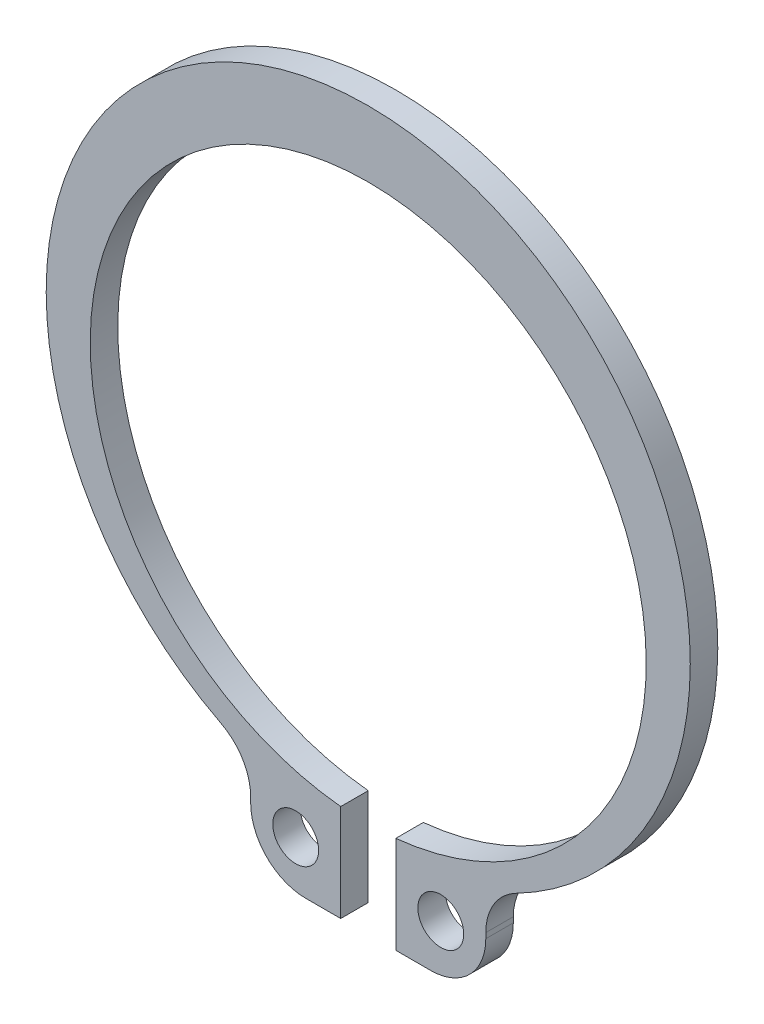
ISO-10303-21;
HEADER;
FILE_DESCRIPTION(('STEP AP214'),'2;1');
FILE_NAME('part.step','',(''),(''),'','','');
FILE_SCHEMA(('AUTOMOTIVE_DESIGN { 1 0 10303 214 1 1 1 1 }'));
ENDSEC;
DATA;
#1=APPLICATION_CONTEXT('core data for automotive mechanical design processes');
#2=APPLICATION_PROTOCOL_DEFINITION('international standard','automotive_design',2000,#1);
#3=PRODUCT_CONTEXT('',#1,'mechanical');
#4=PRODUCT('Part','Part','',(#3));
#5=PRODUCT_RELATED_PRODUCT_CATEGORY('part','',(#4));
#6=PRODUCT_DEFINITION_FORMATION('','',#4);
#7=PRODUCT_DEFINITION_CONTEXT('part definition',#1,'design');
#8=PRODUCT_DEFINITION('design','',#6,#7);
#9=PRODUCT_DEFINITION_SHAPE('','',#8);
#10=(LENGTH_UNIT() NAMED_UNIT(*) SI_UNIT(.MILLI.,.METRE.));
#11=(NAMED_UNIT(*) PLANE_ANGLE_UNIT() SI_UNIT($,.RADIAN.));
#12=(NAMED_UNIT(*) SI_UNIT($,.STERADIAN.) SOLID_ANGLE_UNIT());
#13=UNCERTAINTY_MEASURE_WITH_UNIT(LENGTH_MEASURE(1.E-05),#10,'distance_accuracy_value','');
#14=(GEOMETRIC_REPRESENTATION_CONTEXT(3) GLOBAL_UNCERTAINTY_ASSIGNED_CONTEXT((#13)) GLOBAL_UNIT_ASSIGNED_CONTEXT((#10,
#11,#12)) REPRESENTATION_CONTEXT('',''));
#15=CARTESIAN_POINT('',(0.,0.,0.));
#16=DIRECTION('',(0.,0.,1.));
#17=DIRECTION('',(1.,0.,0.));
#18=AXIS2_PLACEMENT_3D('',#15,#16,#17);
#19=CARTESIAN_POINT('',(-9.40667556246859,-17.0706583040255,1.5));
#20=DIRECTION('',(0.,0.,-1.));
#21=DIRECTION('',(-1.,0.,0.));
#22=AXIS2_PLACEMENT_3D('',#19,#20,#21);
#23=CYLINDRICAL_SURFACE('',#22,3.);
#24=CARTESIAN_POINT('',(-9.40667556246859,-17.0706583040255,0.));
#25=DIRECTION('',(0.,0.,1.));
#26=DIRECTION('',(1.,0.,0.));
#27=AXIS2_PLACEMENT_3D('',#24,#25,#26);
#28=CIRCLE('',#27,3.);
#29=CARTESIAN_POINT('',(-6.40667556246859,-17.0706583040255,0.));
#30=VERTEX_POINT('',#29);
#31=CARTESIAN_POINT('',(-8.03343825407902,-14.4034089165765,0.));
#32=VERTEX_POINT('',#31);
#33=EDGE_CURVE('E125',#30,#32,#28,.T.);
#34=ORIENTED_EDGE('',*,*,#33,.F.);
#35=DIRECTION('',(0.,0.,-1.));
#36=VECTOR('',#35,1.);
#37=CARTESIAN_POINT('',(-6.40667556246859,-17.0706583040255,1.5));
#38=LINE('',#37,#36);
#39=CARTESIAN_POINT('',(-6.40667556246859,-17.0706583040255,1.5));
#40=VERTEX_POINT('',#39);
#41=EDGE_CURVE('E30',#40,#30,#38,.T.);
#42=ORIENTED_EDGE('',*,*,#41,.F.);
#43=CARTESIAN_POINT('',(-9.40667556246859,-17.0706583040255,1.5));
#44=DIRECTION('',(0.,0.,1.));
#45=DIRECTION('',(1.,0.,0.));
#46=AXIS2_PLACEMENT_3D('',#43,#44,#45);
#47=CIRCLE('',#46,3.);
#48=CARTESIAN_POINT('',(-8.03343825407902,-14.4034089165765,1.5));
#49=VERTEX_POINT('',#48);
#50=EDGE_CURVE('E155',#40,#49,#47,.T.);
#51=ORIENTED_EDGE('',*,*,#50,.T.);
#52=DIRECTION('',(0.,0.,-1.));
#53=VECTOR('',#52,1.);
#54=CARTESIAN_POINT('',(-8.03343825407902,-14.4034089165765,1.5));
#55=LINE('',#54,#53);
#56=EDGE_CURVE('E11',#49,#32,#55,.T.);
#57=ORIENTED_EDGE('',*,*,#56,.T.);
#58=EDGE_LOOP('',(#34,#42,#51,#57));
#59=FACE_BOUND('',#58,.T.);
#60=ADVANCED_FACE('F16',(#59),#23,.F.);
#61=CARTESIAN_POINT('',(0.,1.2,1.5));
#62=DIRECTION('',(0.,0.,-1.));
#63=DIRECTION('',(-1.,0.,0.));
#64=AXIS2_PLACEMENT_3D('',#61,#62,#63);
#65=CYLINDRICAL_SURFACE('',#64,17.55);
#66=CARTESIAN_POINT('',(0.,1.2,0.));
#67=DIRECTION('',(0.,0.,1.));
#68=DIRECTION('',(1.,0.,0.));
#69=AXIS2_PLACEMENT_3D('',#66,#67,#68);
#70=CIRCLE('',#69,17.55);
#71=CARTESIAN_POINT('',(8.033438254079,-14.4034089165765,0.));
#72=VERTEX_POINT('',#71);
#73=EDGE_CURVE('E107',#72,#32,#70,.T.);
#74=ORIENTED_EDGE('',*,*,#73,.T.);
#75=ORIENTED_EDGE('',*,*,#56,.F.);
#76=CARTESIAN_POINT('',(0.,1.2,1.5));
#77=DIRECTION('',(0.,0.,1.));
#78=DIRECTION('',(1.,0.,0.));
#79=AXIS2_PLACEMENT_3D('',#76,#77,#78);
#80=CIRCLE('',#79,17.55);
#81=CARTESIAN_POINT('',(8.033438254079,-14.4034089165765,1.5));
#82=VERTEX_POINT('',#81);
#83=EDGE_CURVE('E110',#82,#49,#80,.T.);
#84=ORIENTED_EDGE('',*,*,#83,.F.);
#85=DIRECTION('',(0.,0.,-1.));
#86=VECTOR('',#85,1.);
#87=CARTESIAN_POINT('',(8.033438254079,-14.4034089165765,1.5));
#88=LINE('',#87,#86);
#89=EDGE_CURVE('E19',#82,#72,#88,.T.);
#90=ORIENTED_EDGE('',*,*,#89,.T.);
#91=EDGE_LOOP('',(#74,#75,#84,#90));
#92=FACE_BOUND('',#91,.T.);
#93=ADVANCED_FACE('F105',(#92),#65,.T.);
#94=CARTESIAN_POINT('',(9.40667556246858,-17.0706583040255,1.5));
#95=DIRECTION('',(0.,0.,-1.));
#96=DIRECTION('',(-1.,0.,0.));
#97=AXIS2_PLACEMENT_3D('',#94,#95,#96);
#98=CYLINDRICAL_SURFACE('',#97,3.);
#99=CARTESIAN_POINT('',(9.40667556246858,-17.0706583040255,0.));
#100=DIRECTION('',(0.,0.,1.));
#101=DIRECTION('',(1.,0.,0.));
#102=AXIS2_PLACEMENT_3D('',#99,#100,#101);
#103=CIRCLE('',#102,3.);
#104=CARTESIAN_POINT('',(6.40667556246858,-17.0706583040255,0.));
#105=VERTEX_POINT('',#104);
#106=EDGE_CURVE('E116',#72,#105,#103,.T.);
#107=ORIENTED_EDGE('',*,*,#106,.F.);
#108=ORIENTED_EDGE('',*,*,#89,.F.);
#109=CARTESIAN_POINT('',(9.40667556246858,-17.0706583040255,1.5));
#110=DIRECTION('',(0.,0.,1.));
#111=DIRECTION('',(1.,0.,0.));
#112=AXIS2_PLACEMENT_3D('',#109,#110,#111);
#113=CIRCLE('',#112,3.);
#114=CARTESIAN_POINT('',(6.40667556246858,-17.0706583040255,1.5));
#115=VERTEX_POINT('',#114);
#116=EDGE_CURVE('E158',#82,#115,#113,.T.);
#117=ORIENTED_EDGE('',*,*,#116,.T.);
#118=DIRECTION('',(0.,0.,-1.));
#119=VECTOR('',#118,1.);
#120=CARTESIAN_POINT('',(6.40667556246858,-17.0706583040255,1.5));
#121=LINE('',#120,#119);
#122=EDGE_CURVE('E114',#115,#105,#121,.T.);
#123=ORIENTED_EDGE('',*,*,#122,.T.);
#124=EDGE_LOOP('',(#107,#108,#117,#123));
#125=FACE_BOUND('',#124,.T.);
#126=ADVANCED_FACE('F117',(#125),#98,.F.);
#127=CARTESIAN_POINT('',(6.40667556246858,-17.36,1.5));
#128=DIRECTION('',(-1.,0.,0.));
#129=DIRECTION('',(0.,-1.,0.));
#130=AXIS2_PLACEMENT_3D('',#127,#128,#129);
#131=PLANE('',#130);
#132=DIRECTION('',(0.,1.,0.));
#133=VECTOR('',#132,1.);
#134=CARTESIAN_POINT('',(6.40667556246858,-17.36,0.));
#135=LINE('',#134,#133);
#136=CARTESIAN_POINT('',(6.40667556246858,-17.36,0.));
#137=VERTEX_POINT('',#136);
#138=EDGE_CURVE('E121',#137,#105,#135,.T.);
#139=ORIENTED_EDGE('',*,*,#138,.T.);
#140=ORIENTED_EDGE('',*,*,#122,.F.);
#141=DIRECTION('',(0.,1.,0.));
#142=VECTOR('',#141,1.);
#143=CARTESIAN_POINT('',(6.40667556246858,-17.36,1.5));
#144=LINE('',#143,#142);
#145=CARTESIAN_POINT('',(6.40667556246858,-17.36,1.5));
#146=VERTEX_POINT('',#145);
#147=EDGE_CURVE('E160',#146,#115,#144,.T.);
#148=ORIENTED_EDGE('',*,*,#147,.F.);
#149=DIRECTION('',(0.,0.,-1.));
#150=VECTOR('',#149,1.);
#151=CARTESIAN_POINT('',(6.40667556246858,-17.36,1.5));
#152=LINE('',#151,#150);
#153=EDGE_CURVE('E202',#146,#137,#152,.T.);
#154=ORIENTED_EDGE('',*,*,#153,.T.);
#155=EDGE_LOOP('',(#139,#140,#148,#154));
#156=FACE_BOUND('',#155,.T.);
#157=ADVANCED_FACE('F206',(#156),#131,.F.);
#158=CARTESIAN_POINT('',(3.40667556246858,-17.36,1.5));
#159=DIRECTION('',(0.,0.,-1.));
#160=DIRECTION('',(-1.,0.,0.));
#161=AXIS2_PLACEMENT_3D('',#158,#159,#160);
#162=CYLINDRICAL_SURFACE('',#161,3.);
#163=CARTESIAN_POINT('',(3.40667556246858,-17.36,0.));
#164=DIRECTION('',(0.,0.,1.));
#165=DIRECTION('',(1.,0.,0.));
#166=AXIS2_PLACEMENT_3D('',#163,#164,#165);
#167=CIRCLE('',#166,3.);
#168=CARTESIAN_POINT('',(3.40667556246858,-20.36,0.));
#169=VERTEX_POINT('',#168);
#170=EDGE_CURVE('E133',#169,#137,#167,.T.);
#171=ORIENTED_EDGE('',*,*,#170,.T.);
#172=ORIENTED_EDGE('',*,*,#153,.F.);
#173=CARTESIAN_POINT('',(3.40667556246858,-17.36,1.5));
#174=DIRECTION('',(0.,0.,1.));
#175=DIRECTION('',(1.,0.,0.));
#176=AXIS2_PLACEMENT_3D('',#173,#174,#175);
#177=CIRCLE('',#176,3.);
#178=CARTESIAN_POINT('',(3.40667556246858,-20.36,1.5));
#179=VERTEX_POINT('',#178);
#180=EDGE_CURVE('E163',#179,#146,#177,.T.);
#181=ORIENTED_EDGE('',*,*,#180,.F.);
#182=DIRECTION('',(0.,0.,-1.));
#183=VECTOR('',#182,1.);
#184=CARTESIAN_POINT('',(3.40667556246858,-20.36,1.5));
#185=LINE('',#184,#183);
#186=EDGE_CURVE('E200',#179,#169,#185,.T.);
#187=ORIENTED_EDGE('',*,*,#186,.T.);
#188=EDGE_LOOP('',(#171,#172,#181,#187));
#189=FACE_BOUND('',#188,.T.);
#190=ADVANCED_FACE('F210',(#189),#162,.T.);
#191=CARTESIAN_POINT('',(1.5,-20.36,1.5));
#192=DIRECTION('',(0.,1.,0.));
#193=DIRECTION('',(0.,0.,1.));
#194=AXIS2_PLACEMENT_3D('',#191,#192,#193);
#195=PLANE('',#194);
#196=DIRECTION('',(1.,0.,0.));
#197=VECTOR('',#196,1.);
#198=CARTESIAN_POINT('',(1.5,-20.36,0.));
#199=LINE('',#198,#197);
#200=CARTESIAN_POINT('',(1.5,-20.36,0.));
#201=VERTEX_POINT('',#200);
#202=EDGE_CURVE('E136',#201,#169,#199,.T.);
#203=ORIENTED_EDGE('',*,*,#202,.T.);
#204=ORIENTED_EDGE('',*,*,#186,.F.);
#205=DIRECTION('',(1.,0.,0.));
#206=VECTOR('',#205,1.);
#207=CARTESIAN_POINT('',(1.5,-20.36,1.5));
#208=LINE('',#207,#206);
#209=CARTESIAN_POINT('',(1.5,-20.36,1.5));
#210=VERTEX_POINT('',#209);
#211=EDGE_CURVE('E166',#210,#179,#208,.T.);
#212=ORIENTED_EDGE('',*,*,#211,.F.);
#213=DIRECTION('',(0.,0.,-1.));
#214=VECTOR('',#213,1.);
#215=CARTESIAN_POINT('',(1.5,-20.36,1.5));
#216=LINE('',#215,#214);
#217=EDGE_CURVE('E198',#210,#201,#216,.T.);
#218=ORIENTED_EDGE('',*,*,#217,.T.);
#219=EDGE_LOOP('',(#203,#204,#212,#218));
#220=FACE_BOUND('',#219,.T.);
#221=ADVANCED_FACE('F214',(#220),#195,.F.);
#222=CARTESIAN_POINT('',(1.5,-20.36,1.5));
#223=DIRECTION('',(-1.,0.,0.));
#224=DIRECTION('',(0.,-1.,0.));
#225=AXIS2_PLACEMENT_3D('',#222,#223,#224);
#226=PLANE('',#225);
#227=DIRECTION('',(0.,1.,0.));
#228=VECTOR('',#227,1.);
#229=CARTESIAN_POINT('',(1.5,-20.36,0.));
#230=LINE('',#229,#228);
#231=CARTESIAN_POINT('',(1.5,-15.0755596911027,0.));
#232=VERTEX_POINT('',#231);
#233=EDGE_CURVE('E139',#201,#232,#230,.T.);
#234=ORIENTED_EDGE('',*,*,#233,.F.);
#235=ORIENTED_EDGE('',*,*,#217,.F.);
#236=DIRECTION('',(0.,1.,0.));
#237=VECTOR('',#236,1.);
#238=CARTESIAN_POINT('',(1.5,-20.36,1.5));
#239=LINE('',#238,#237);
#240=CARTESIAN_POINT('',(1.5,-15.0755596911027,1.5));
#241=VERTEX_POINT('',#240);
#242=EDGE_CURVE('E169',#210,#241,#239,.T.);
#243=ORIENTED_EDGE('',*,*,#242,.T.);
#244=DIRECTION('',(0.,0.,-1.));
#245=VECTOR('',#244,1.);
#246=CARTESIAN_POINT('',(1.5,-15.0755596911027,1.5));
#247=LINE('',#246,#245);
#248=EDGE_CURVE('E196',#241,#232,#247,.T.);
#249=ORIENTED_EDGE('',*,*,#248,.T.);
#250=EDGE_LOOP('',(#234,#235,#243,#249));
#251=FACE_BOUND('',#250,.T.);
#252=ADVANCED_FACE('F218',(#251),#226,.T.);
#253=CARTESIAN_POINT('',(0.,0.,1.5));
#254=DIRECTION('',(0.,0.,-1.));
#255=DIRECTION('',(-1.,0.,0.));
#256=AXIS2_PLACEMENT_3D('',#253,#254,#255);
#257=CYLINDRICAL_SURFACE('',#256,15.15);
#258=CARTESIAN_POINT('',(0.,0.,0.));
#259=DIRECTION('',(0.,0.,1.));
#260=DIRECTION('',(1.,0.,0.));
#261=AXIS2_PLACEMENT_3D('',#258,#259,#260);
#262=CIRCLE('',#261,15.15);
#263=CARTESIAN_POINT('',(-1.5,-15.0755596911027,0.));
#264=VERTEX_POINT('',#263);
#265=EDGE_CURVE('E142',#232,#264,#262,.T.);
#266=ORIENTED_EDGE('',*,*,#265,.F.);
#267=ORIENTED_EDGE('',*,*,#248,.F.);
#268=CARTESIAN_POINT('',(0.,0.,1.5));
#269=DIRECTION('',(0.,0.,1.));
#270=DIRECTION('',(1.,0.,0.));
#271=AXIS2_PLACEMENT_3D('',#268,#269,#270);
#272=CIRCLE('',#271,15.15);
#273=CARTESIAN_POINT('',(-1.5,-15.0755596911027,1.5));
#274=VERTEX_POINT('',#273);
#275=EDGE_CURVE('E172',#241,#274,#272,.T.);
#276=ORIENTED_EDGE('',*,*,#275,.T.);
#277=DIRECTION('',(0.,0.,-1.));
#278=VECTOR('',#277,1.);
#279=CARTESIAN_POINT('',(-1.5,-15.0755596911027,1.5));
#280=LINE('',#279,#278);
#281=EDGE_CURVE('E194',#274,#264,#280,.T.);
#282=ORIENTED_EDGE('',*,*,#281,.T.);
#283=EDGE_LOOP('',(#266,#267,#276,#282));
#284=FACE_BOUND('',#283,.T.);
#285=ADVANCED_FACE('F222',(#284),#257,.F.);
#286=CARTESIAN_POINT('',(-1.5,-20.36,1.5));
#287=DIRECTION('',(-1.,0.,0.));
#288=DIRECTION('',(0.,-1.,0.));
#289=AXIS2_PLACEMENT_3D('',#286,#287,#288);
#290=PLANE('',#289);
#291=DIRECTION('',(0.,1.,0.));
#292=VECTOR('',#291,1.);
#293=CARTESIAN_POINT('',(-1.5,-20.36,0.));
#294=LINE('',#293,#292);
#295=CARTESIAN_POINT('',(-1.5,-20.36,0.));
#296=VERTEX_POINT('',#295);
#297=EDGE_CURVE('E145',#296,#264,#294,.T.);
#298=ORIENTED_EDGE('',*,*,#297,.T.);
#299=ORIENTED_EDGE('',*,*,#281,.F.);
#300=DIRECTION('',(0.,1.,0.));
#301=VECTOR('',#300,1.);
#302=CARTESIAN_POINT('',(-1.5,-20.36,1.5));
#303=LINE('',#302,#301);
#304=CARTESIAN_POINT('',(-1.5,-20.36,1.5));
#305=VERTEX_POINT('',#304);
#306=EDGE_CURVE('E175',#305,#274,#303,.T.);
#307=ORIENTED_EDGE('',*,*,#306,.F.);
#308=DIRECTION('',(0.,0.,-1.));
#309=VECTOR('',#308,1.);
#310=CARTESIAN_POINT('',(-1.5,-20.36,1.5));
#311=LINE('',#310,#309);
#312=EDGE_CURVE('E192',#305,#296,#311,.T.);
#313=ORIENTED_EDGE('',*,*,#312,.T.);
#314=EDGE_LOOP('',(#298,#299,#307,#313));
#315=FACE_BOUND('',#314,.T.);
#316=ADVANCED_FACE('F227',(#315),#290,.F.);
#317=CARTESIAN_POINT('',(-3.40667556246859,-20.36,1.5));
#318=DIRECTION('',(0.,1.,0.));
#319=DIRECTION('',(0.,0.,1.));
#320=AXIS2_PLACEMENT_3D('',#317,#318,#319);
#321=PLANE('',#320);
#322=DIRECTION('',(1.,0.,0.));
#323=VECTOR('',#322,1.);
#324=CARTESIAN_POINT('',(-3.40667556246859,-20.36,0.));
#325=LINE('',#324,#323);
#326=CARTESIAN_POINT('',(-3.40667556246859,-20.36,0.));
#327=VERTEX_POINT('',#326);
#328=EDGE_CURVE('E148',#327,#296,#325,.T.);
#329=ORIENTED_EDGE('',*,*,#328,.T.);
#330=ORIENTED_EDGE('',*,*,#312,.F.);
#331=DIRECTION('',(1.,0.,0.));
#332=VECTOR('',#331,1.);
#333=CARTESIAN_POINT('',(-3.40667556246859,-20.36,1.5));
#334=LINE('',#333,#332);
#335=CARTESIAN_POINT('',(-3.40667556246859,-20.36,1.5));
#336=VERTEX_POINT('',#335);
#337=EDGE_CURVE('E178',#336,#305,#334,.T.);
#338=ORIENTED_EDGE('',*,*,#337,.F.);
#339=DIRECTION('',(0.,0.,-1.));
#340=VECTOR('',#339,1.);
#341=CARTESIAN_POINT('',(-3.40667556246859,-20.36,1.5));
#342=LINE('',#341,#340);
#343=EDGE_CURVE('E190',#336,#327,#342,.T.);
#344=ORIENTED_EDGE('',*,*,#343,.T.);
#345=EDGE_LOOP('',(#329,#330,#338,#344));
#346=FACE_BOUND('',#345,.T.);
#347=ADVANCED_FACE('F231',(#346),#321,.F.);
#348=CARTESIAN_POINT('',(-3.40667556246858,-17.36,1.5));
#349=DIRECTION('',(0.,0.,-1.));
#350=DIRECTION('',(-1.,0.,0.));
#351=AXIS2_PLACEMENT_3D('',#348,#349,#350);
#352=CYLINDRICAL_SURFACE('',#351,3.);
#353=CARTESIAN_POINT('',(-3.40667556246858,-17.36,0.));
#354=DIRECTION('',(0.,0.,1.));
#355=DIRECTION('',(1.,0.,0.));
#356=AXIS2_PLACEMENT_3D('',#353,#354,#355);
#357=CIRCLE('',#356,3.);
#358=CARTESIAN_POINT('',(-6.40667556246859,-17.36,0.));
#359=VERTEX_POINT('',#358);
#360=EDGE_CURVE('E151',#359,#327,#357,.T.);
#361=ORIENTED_EDGE('',*,*,#360,.T.);
#362=ORIENTED_EDGE('',*,*,#343,.F.);
#363=CARTESIAN_POINT('',(-3.40667556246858,-17.36,1.5));
#364=DIRECTION('',(0.,0.,1.));
#365=DIRECTION('',(1.,0.,0.));
#366=AXIS2_PLACEMENT_3D('',#363,#364,#365);
#367=CIRCLE('',#366,3.);
#368=CARTESIAN_POINT('',(-6.40667556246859,-17.36,1.5));
#369=VERTEX_POINT('',#368);
#370=EDGE_CURVE('E181',#369,#336,#367,.T.);
#371=ORIENTED_EDGE('',*,*,#370,.F.);
#372=DIRECTION('',(0.,0.,-1.));
#373=VECTOR('',#372,1.);
#374=CARTESIAN_POINT('',(-6.40667556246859,-17.36,1.5));
#375=LINE('',#374,#373);
#376=EDGE_CURVE('E37',#369,#359,#375,.T.);
#377=ORIENTED_EDGE('',*,*,#376,.T.);
#378=EDGE_LOOP('',(#361,#362,#371,#377));
#379=FACE_BOUND('',#378,.T.);
#380=ADVANCED_FACE('F233',(#379),#352,.T.);
#381=CARTESIAN_POINT('',(-6.40667556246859,-17.0706583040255,1.5));
#382=DIRECTION('',(1.,0.,0.));
#383=DIRECTION('',(0.,0.,-1.));
#384=AXIS2_PLACEMENT_3D('',#381,#382,#383);
#385=PLANE('',#384);
#386=DIRECTION('',(0.,-1.,0.));
#387=VECTOR('',#386,1.);
#388=CARTESIAN_POINT('',(-6.40667556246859,-17.0706583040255,0.));
#389=LINE('',#388,#387);
#390=EDGE_CURVE('E154',#30,#359,#389,.T.);
#391=ORIENTED_EDGE('',*,*,#390,.T.);
#392=ORIENTED_EDGE('',*,*,#376,.F.);
#393=DIRECTION('',(0.,-1.,0.));
#394=VECTOR('',#393,1.);
#395=CARTESIAN_POINT('',(-6.40667556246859,-17.0706583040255,1.5));
#396=LINE('',#395,#394);
#397=EDGE_CURVE('E184',#40,#369,#396,.T.);
#398=ORIENTED_EDGE('',*,*,#397,.F.);
#399=ORIENTED_EDGE('',*,*,#41,.T.);
#400=EDGE_LOOP('',(#391,#392,#398,#399));
#401=FACE_BOUND('',#400,.T.);
#402=ADVANCED_FACE('F237',(#401),#385,.F.);
#403=CARTESIAN_POINT('',(-9.40667556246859,-17.0706583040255,1.5));
#404=DIRECTION('',(0.,0.,1.));
#405=DIRECTION('',(1.,0.,0.));
#406=AXIS2_PLACEMENT_3D('',#403,#404,#405);
#407=PLANE('',#406);
#408=CARTESIAN_POINT('',(-3.95333778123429,-17.75,1.5));
#409=DIRECTION('',(0.,0.,-1.));
#410=DIRECTION('',(0.,1.,0.));
#411=AXIS2_PLACEMENT_3D('',#408,#409,#410);
#412=CIRCLE('',#411,1.25);
#413=CARTESIAN_POINT('',(-3.95333778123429,-16.5,1.5));
#414=VERTEX_POINT('',#413);
#415=EDGE_CURVE('E331',#414,#414,#412,.T.);
#416=ORIENTED_EDGE('',*,*,#415,.T.);
#417=EDGE_LOOP('',(#416));
#418=FACE_BOUND('',#417,.T.);
#419=CARTESIAN_POINT('',(3.95333778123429,-17.75,1.5));
#420=DIRECTION('',(0.,0.,-1.));
#421=DIRECTION('',(0.,1.,0.));
#422=AXIS2_PLACEMENT_3D('',#419,#420,#421);
#423=CIRCLE('',#422,1.25);
#424=CARTESIAN_POINT('',(3.95333778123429,-16.5,1.5));
#425=VERTEX_POINT('',#424);
#426=EDGE_CURVE('E127',#425,#425,#423,.T.);
#427=ORIENTED_EDGE('',*,*,#426,.T.);
#428=EDGE_LOOP('',(#427));
#429=FACE_BOUND('',#428,.T.);
#430=ORIENTED_EDGE('',*,*,#50,.F.);
#431=ORIENTED_EDGE('',*,*,#397,.T.);
#432=ORIENTED_EDGE('',*,*,#370,.T.);
#433=ORIENTED_EDGE('',*,*,#337,.T.);
#434=ORIENTED_EDGE('',*,*,#306,.T.);
#435=ORIENTED_EDGE('',*,*,#275,.F.);
#436=ORIENTED_EDGE('',*,*,#242,.F.);
#437=ORIENTED_EDGE('',*,*,#211,.T.);
#438=ORIENTED_EDGE('',*,*,#180,.T.);
#439=ORIENTED_EDGE('',*,*,#147,.T.);
#440=ORIENTED_EDGE('',*,*,#116,.F.);
#441=ORIENTED_EDGE('',*,*,#83,.T.);
#442=EDGE_LOOP('',(#430,#431,#432,#433,#434,#435,#436,#437,#438,#439,#440,#441));
#443=FACE_BOUND('',#442,.T.);
#444=ADVANCED_FACE('F236',(#418,#429,#443),#407,.T.);
#445=CARTESIAN_POINT('',(-9.40667556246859,-17.0706583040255,0.));
#446=DIRECTION('',(0.,0.,1.));
#447=DIRECTION('',(1.,0.,0.));
#448=AXIS2_PLACEMENT_3D('',#445,#446,#447);
#449=PLANE('',#448);
#450=CARTESIAN_POINT('',(-3.95333778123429,-17.75,0.));
#451=DIRECTION('',(0.,0.,1.));
#452=DIRECTION('',(0.,1.,0.));
#453=AXIS2_PLACEMENT_3D('',#450,#451,#452);
#454=CIRCLE('',#453,1.25);
#455=CARTESIAN_POINT('',(-3.95333778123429,-16.5,0.));
#456=VERTEX_POINT('',#455);
#457=EDGE_CURVE('E334',#456,#456,#454,.T.);
#458=ORIENTED_EDGE('',*,*,#457,.T.);
#459=EDGE_LOOP('',(#458));
#460=FACE_BOUND('',#459,.T.);
#461=CARTESIAN_POINT('',(3.95333778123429,-17.75,0.));
#462=DIRECTION('',(0.,0.,1.));
#463=DIRECTION('',(0.,1.,0.));
#464=AXIS2_PLACEMENT_3D('',#461,#462,#463);
#465=CIRCLE('',#464,1.25);
#466=CARTESIAN_POINT('',(3.95333778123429,-16.5,0.));
#467=VERTEX_POINT('',#466);
#468=EDGE_CURVE('E336',#467,#467,#465,.T.);
#469=ORIENTED_EDGE('',*,*,#468,.T.);
#470=EDGE_LOOP('',(#469));
#471=FACE_BOUND('',#470,.T.);
#472=ORIENTED_EDGE('',*,*,#33,.T.);
#473=ORIENTED_EDGE('',*,*,#73,.F.);
#474=ORIENTED_EDGE('',*,*,#106,.T.);
#475=ORIENTED_EDGE('',*,*,#138,.F.);
#476=ORIENTED_EDGE('',*,*,#170,.F.);
#477=ORIENTED_EDGE('',*,*,#202,.F.);
#478=ORIENTED_EDGE('',*,*,#233,.T.);
#479=ORIENTED_EDGE('',*,*,#265,.T.);
#480=ORIENTED_EDGE('',*,*,#297,.F.);
#481=ORIENTED_EDGE('',*,*,#328,.F.);
#482=ORIENTED_EDGE('',*,*,#360,.F.);
#483=ORIENTED_EDGE('',*,*,#390,.F.);
#484=EDGE_LOOP('',(#472,#473,#474,#475,#476,#477,#478,#479,#480,#481,#482,#483));
#485=FACE_BOUND('',#484,.T.);
#486=ADVANCED_FACE('F123',(#460,#471,#485),#449,.F.);
#487=CARTESIAN_POINT('',(3.95333778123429,-17.75,0.));
#488=DIRECTION('',(0.,0.,1.));
#489=DIRECTION('',(0.,1.,0.));
#490=AXIS2_PLACEMENT_3D('',#487,#488,#489);
#491=CYLINDRICAL_SURFACE('',#490,1.25);
#492=ORIENTED_EDGE('',*,*,#426,.F.);
#493=EDGE_LOOP('',(#492));
#494=FACE_BOUND('',#493,.T.);
#495=ORIENTED_EDGE('',*,*,#468,.F.);
#496=EDGE_LOOP('',(#495));
#497=FACE_BOUND('',#496,.T.);
#498=ADVANCED_FACE('F302',(#494,#497),#491,.F.);
#499=CARTESIAN_POINT('',(-3.95333778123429,-17.75,0.));
#500=DIRECTION('',(0.,0.,1.));
#501=DIRECTION('',(0.,1.,0.));
#502=AXIS2_PLACEMENT_3D('',#499,#500,#501);
#503=CYLINDRICAL_SURFACE('',#502,1.25);
#504=ORIENTED_EDGE('',*,*,#415,.F.);
#505=EDGE_LOOP('',(#504));
#506=FACE_BOUND('',#505,.T.);
#507=ORIENTED_EDGE('',*,*,#457,.F.);
#508=EDGE_LOOP('',(#507));
#509=FACE_BOUND('',#508,.T.);
#510=ADVANCED_FACE('F312',(#506,#509),#503,.F.);
#511=CLOSED_SHELL('',(#60,#93,#126,#157,#190,#221,#252,#285,#316,#347,#380,#402,#444,#486,#498,#510));
#512=MANIFOLD_SOLID_BREP('B1',#511);
#513=ADVANCED_BREP_SHAPE_REPRESENTATION('',(#18,#512),#14);
#514=SHAPE_DEFINITION_REPRESENTATION(#9,#513);
ENDSEC;
END-ISO-10303-21;
